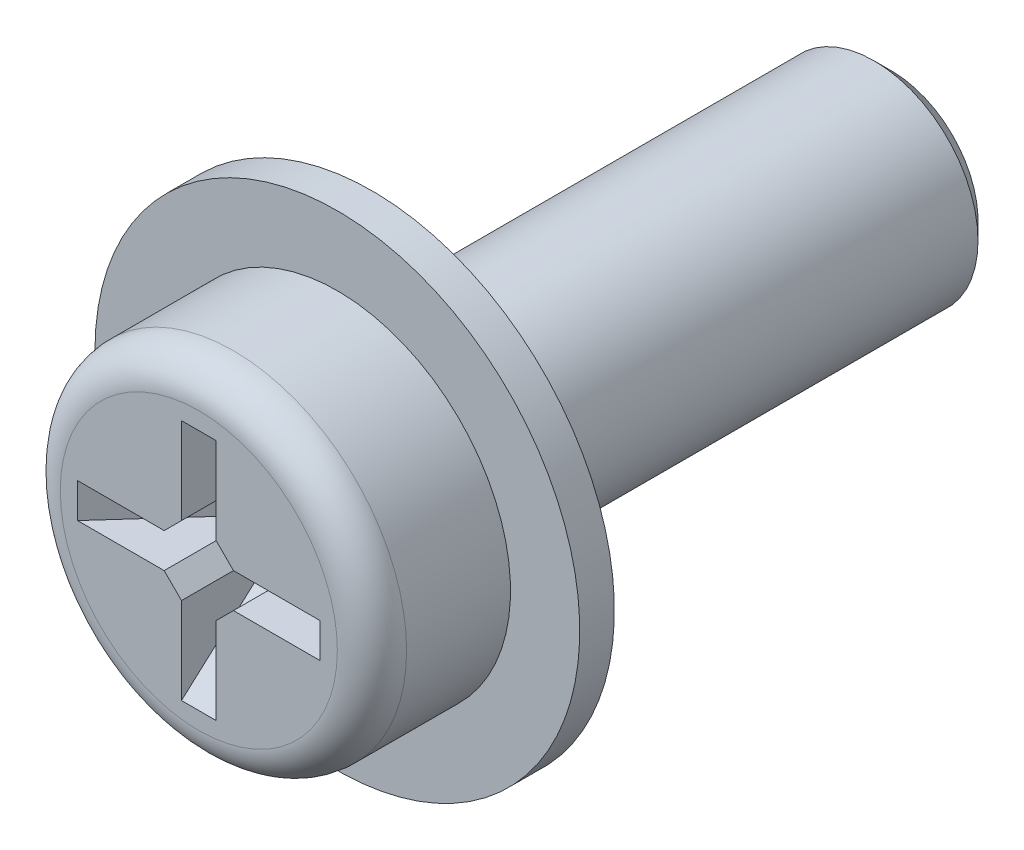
ISO-10303-21;
HEADER;
FILE_DESCRIPTION(('STEP AP214'),'2;1');
FILE_NAME('part.step','',(''),(''),'','','');
FILE_SCHEMA(('AUTOMOTIVE_DESIGN { 1 0 10303 214 1 1 1 1 }'));
ENDSEC;
DATA;
#1=APPLICATION_CONTEXT('core data for automotive mechanical design processes');
#2=APPLICATION_PROTOCOL_DEFINITION('international standard','automotive_design',2000,#1);
#3=PRODUCT_CONTEXT('',#1,'mechanical');
#4=PRODUCT('Part','Part','',(#3));
#5=PRODUCT_RELATED_PRODUCT_CATEGORY('part','',(#4));
#6=PRODUCT_DEFINITION_FORMATION('','',#4);
#7=PRODUCT_DEFINITION_CONTEXT('part definition',#1,'design');
#8=PRODUCT_DEFINITION('design','',#6,#7);
#9=PRODUCT_DEFINITION_SHAPE('','',#8);
#10=(LENGTH_UNIT() NAMED_UNIT(*) SI_UNIT(.MILLI.,.METRE.));
#11=(NAMED_UNIT(*) PLANE_ANGLE_UNIT() SI_UNIT($,.RADIAN.));
#12=(NAMED_UNIT(*) SI_UNIT($,.STERADIAN.) SOLID_ANGLE_UNIT());
#13=UNCERTAINTY_MEASURE_WITH_UNIT(LENGTH_MEASURE(1.E-05),#10,'distance_accuracy_value','');
#14=(GEOMETRIC_REPRESENTATION_CONTEXT(3) GLOBAL_UNCERTAINTY_ASSIGNED_CONTEXT((#13)) GLOBAL_UNIT_ASSIGNED_CONTEXT((#10,
#11,#12)) REPRESENTATION_CONTEXT('',''));
#15=CARTESIAN_POINT('',(0.,0.,0.));
#16=DIRECTION('',(0.,0.,1.));
#17=DIRECTION('',(1.,0.,0.));
#18=AXIS2_PLACEMENT_3D('',#15,#16,#17);
#19=CARTESIAN_POINT('',(1.75,0.25,2.));
#20=DIRECTION('',(-0.743144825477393,0.,0.669130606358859));
#21=DIRECTION('',(0.669130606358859,0.,0.743144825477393));
#22=AXIS2_PLACEMENT_3D('',#19,#20,#21);
#23=PLANE('',#22);
#24=DIRECTION('',(-0.669130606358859,0.,-0.743144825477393));
#25=VECTOR('',#24,1.);
#26=CARTESIAN_POINT('',(1.75,0.25,2.));
#27=LINE('',#26,#25);
#28=CARTESIAN_POINT('',(0.500000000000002,0.249999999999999,0.611734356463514));
#29=VERTEX_POINT('',#28);
#30=CARTESIAN_POINT('',(1.75,0.25,2.));
#31=VERTEX_POINT('',#30);
#32=EDGE_CURVE('E213',#29,#31,#27,.F.);
#33=ORIENTED_EDGE('',*,*,#32,.F.);
#34=DIRECTION('',(-0.556117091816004,0.556117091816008,-0.617630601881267));
#35=VECTOR('',#34,1.);
#36=CARTESIAN_POINT('',(1.36341722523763,-0.61341722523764,1.57065633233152));
#37=LINE('',#36,#35);
#38=CARTESIAN_POINT('',(0.375000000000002,0.375,0.472907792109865));
#39=VERTEX_POINT('',#38);
#40=EDGE_CURVE('E260',#29,#39,#37,.T.);
#41=ORIENTED_EDGE('',*,*,#40,.T.);
#42=DIRECTION('',(-0.556117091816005,-0.556117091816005,-0.617630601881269));
#43=VECTOR('',#42,1.);
#44=CARTESIAN_POINT('',(1.13146756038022,1.13146756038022,1.31305013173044));
#45=LINE('',#44,#43);
#46=CARTESIAN_POINT('',(0.0392323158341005,0.0392323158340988,0.1));
#47=VERTEX_POINT('',#46);
#48=EDGE_CURVE('E232',#39,#47,#45,.T.);
#49=ORIENTED_EDGE('',*,*,#48,.T.);
#50=DIRECTION('',(0.,-1.,0.));
#51=VECTOR('',#50,1.);
#52=CARTESIAN_POINT('',(0.0392323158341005,-0.249999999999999,0.1));
#53=LINE('',#52,#51);
#54=CARTESIAN_POINT('',(0.0392323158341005,-0.0392323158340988,0.1));
#55=VERTEX_POINT('',#54);
#56=EDGE_CURVE('E216',#55,#47,#53,.F.);
#57=ORIENTED_EDGE('',*,*,#56,.F.);
#58=DIRECTION('',(-0.556117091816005,0.556117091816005,-0.617630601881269));
#59=VECTOR('',#58,1.);
#60=CARTESIAN_POINT('',(1.13146756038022,-1.13146756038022,1.31305013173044));
#61=LINE('',#60,#59);
#62=CARTESIAN_POINT('',(0.375000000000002,-0.375,0.472907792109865));
#63=VERTEX_POINT('',#62);
#64=EDGE_CURVE('E53',#63,#55,#61,.T.);
#65=ORIENTED_EDGE('',*,*,#64,.F.);
#66=DIRECTION('',(0.556117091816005,0.556117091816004,0.617630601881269));
#67=VECTOR('',#66,1.);
#68=CARTESIAN_POINT('',(1.51805033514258,0.768050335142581,1.74239379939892));
#69=LINE('',#68,#67);
#70=CARTESIAN_POINT('',(0.500000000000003,-0.249999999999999,0.611734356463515));
#71=VERTEX_POINT('',#70);
#72=EDGE_CURVE('E271',#63,#71,#69,.T.);
#73=ORIENTED_EDGE('',*,*,#72,.T.);
#74=DIRECTION('',(-0.669130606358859,0.,-0.743144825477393));
#75=VECTOR('',#74,1.);
#76=CARTESIAN_POINT('',(0.133600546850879,-0.249999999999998,0.204806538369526));
#77=LINE('',#76,#75);
#78=CARTESIAN_POINT('',(1.75,-0.25,2.));
#79=VERTEX_POINT('',#78);
#80=EDGE_CURVE('E218',#71,#79,#77,.F.);
#81=ORIENTED_EDGE('',*,*,#80,.T.);
#82=DIRECTION('',(0.,1.,0.));
#83=VECTOR('',#82,1.);
#84=CARTESIAN_POINT('',(1.75,0.25,2.));
#85=LINE('',#84,#83);
#86=EDGE_CURVE('E186',#79,#31,#85,.T.);
#87=ORIENTED_EDGE('',*,*,#86,.T.);
#88=EDGE_LOOP('',(#33,#41,#49,#57,#65,#73,#81,#87));
#89=FACE_BOUND('',#88,.T.);
#90=ADVANCED_FACE('F29',(#89),#23,.T.);
#91=CARTESIAN_POINT('',(-0.250000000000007,1.75,2.));
#92=DIRECTION('',(0.,-0.743144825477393,0.669130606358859));
#93=DIRECTION('',(0.,-0.669130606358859,-0.743144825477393));
#94=AXIS2_PLACEMENT_3D('',#91,#92,#93);
#95=PLANE('',#94);
#96=ORIENTED_EDGE('',*,*,#48,.F.);
#97=DIRECTION('',(-0.556117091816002,0.556117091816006,0.61763060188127));
#98=VECTOR('',#97,1.);
#99=CARTESIAN_POINT('',(-0.768050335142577,1.51805033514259,1.74239379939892));
#100=LINE('',#99,#98);
#101=CARTESIAN_POINT('',(0.250000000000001,0.500000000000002,0.611734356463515));
#102=VERTEX_POINT('',#101);
#103=EDGE_CURVE('E263',#39,#102,#100,.T.);
#104=ORIENTED_EDGE('',*,*,#103,.T.);
#105=DIRECTION('',(0.,-0.669130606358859,-0.743144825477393));
#106=VECTOR('',#105,1.);
#107=CARTESIAN_POINT('',(0.250000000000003,0.80520419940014,0.950697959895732));
#108=LINE('',#107,#106);
#109=CARTESIAN_POINT('',(0.250000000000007,1.75,2.));
#110=VERTEX_POINT('',#109);
#111=EDGE_CURVE('E211',#102,#110,#108,.F.);
#112=ORIENTED_EDGE('',*,*,#111,.T.);
#113=DIRECTION('',(-1.,0.,0.));
#114=VECTOR('',#113,1.);
#115=CARTESIAN_POINT('',(-0.250000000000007,1.75,2.));
#116=LINE('',#115,#114);
#117=CARTESIAN_POINT('',(-0.250000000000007,1.75,2.));
#118=VERTEX_POINT('',#117);
#119=EDGE_CURVE('E195',#110,#118,#116,.T.);
#120=ORIENTED_EDGE('',*,*,#119,.T.);
#121=DIRECTION('',(0.,-0.669130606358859,-0.743144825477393));
#122=VECTOR('',#121,1.);
#123=CARTESIAN_POINT('',(-0.250000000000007,1.75,2.));
#124=LINE('',#123,#122);
#125=CARTESIAN_POINT('',(-0.250000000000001,0.5,0.611734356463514));
#126=VERTEX_POINT('',#125);
#127=EDGE_CURVE('E203',#126,#118,#124,.F.);
#128=ORIENTED_EDGE('',*,*,#127,.F.);
#129=DIRECTION('',(-0.556117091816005,-0.556117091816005,-0.617630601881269));
#130=VECTOR('',#129,1.);
#131=CARTESIAN_POINT('',(0.613417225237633,1.36341722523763,1.57065633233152));
#132=LINE('',#131,#130);
#133=CARTESIAN_POINT('',(-0.375000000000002,0.375,0.472907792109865));
#134=VERTEX_POINT('',#133);
#135=EDGE_CURVE('E265',#126,#134,#132,.T.);
#136=ORIENTED_EDGE('',*,*,#135,.T.);
#137=DIRECTION('',(0.556117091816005,-0.556117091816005,-0.617630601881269));
#138=VECTOR('',#137,1.);
#139=CARTESIAN_POINT('',(-1.28610067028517,1.28610067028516,1.48478759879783));
#140=LINE('',#139,#138);
#141=CARTESIAN_POINT('',(-0.0392323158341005,0.0392323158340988,0.1));
#142=VERTEX_POINT('',#141);
#143=EDGE_CURVE('E229',#134,#142,#140,.T.);
#144=ORIENTED_EDGE('',*,*,#143,.T.);
#145=DIRECTION('',(1.,0.,0.));
#146=VECTOR('',#145,1.);
#147=CARTESIAN_POINT('',(-0.249999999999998,0.0392323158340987,0.1));
#148=LINE('',#147,#146);
#149=EDGE_CURVE('E156',#47,#142,#148,.F.);
#150=ORIENTED_EDGE('',*,*,#149,.F.);
#151=EDGE_LOOP('',(#96,#104,#112,#120,#128,#136,#144,#150));
#152=FACE_BOUND('',#151,.T.);
#153=ADVANCED_FACE('F31',(#152),#95,.T.);
#154=CARTESIAN_POINT('',(-0.250000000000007,-1.75,2.));
#155=DIRECTION('',(0.,0.743144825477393,0.669130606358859));
#156=DIRECTION('',(0.,-0.669130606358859,0.743144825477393));
#157=AXIS2_PLACEMENT_3D('',#154,#155,#156);
#158=PLANE('',#157);
#159=DIRECTION('',(0.,0.669130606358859,-0.743144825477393));
#160=VECTOR('',#159,1.);
#161=CARTESIAN_POINT('',(0.250000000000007,-1.75,2.));
#162=LINE('',#161,#160);
#163=CARTESIAN_POINT('',(0.250000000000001,-0.5,0.611734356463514));
#164=VERTEX_POINT('',#163);
#165=CARTESIAN_POINT('',(0.250000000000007,-1.75,2.));
#166=VERTEX_POINT('',#165);
#167=EDGE_CURVE('E220',#164,#166,#162,.F.);
#168=ORIENTED_EDGE('',*,*,#167,.F.);
#169=DIRECTION('',(0.556117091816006,0.556117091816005,-0.617630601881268));
#170=VECTOR('',#169,1.);
#171=CARTESIAN_POINT('',(-0.768050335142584,-1.51805033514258,1.74239379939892));
#172=LINE('',#171,#170);
#173=EDGE_CURVE('E269',#164,#63,#172,.T.);
#174=ORIENTED_EDGE('',*,*,#173,.T.);
#175=ORIENTED_EDGE('',*,*,#64,.T.);
#176=DIRECTION('',(-1.,0.,0.));
#177=VECTOR('',#176,1.);
#178=CARTESIAN_POINT('',(-0.249999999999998,-0.0392323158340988,0.1));
#179=LINE('',#178,#177);
#180=CARTESIAN_POINT('',(-0.0392323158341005,-0.0392323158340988,0.1));
#181=VERTEX_POINT('',#180);
#182=EDGE_CURVE('E208',#181,#55,#179,.F.);
#183=ORIENTED_EDGE('',*,*,#182,.F.);
#184=DIRECTION('',(0.556117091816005,0.556117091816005,-0.617630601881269));
#185=VECTOR('',#184,1.);
#186=CARTESIAN_POINT('',(-1.28610067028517,-1.28610067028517,1.48478759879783));
#187=LINE('',#186,#185);
#188=CARTESIAN_POINT('',(-0.375000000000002,-0.375,0.472907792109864));
#189=VERTEX_POINT('',#188);
#190=EDGE_CURVE('E45',#189,#181,#187,.T.);
#191=ORIENTED_EDGE('',*,*,#190,.F.);
#192=DIRECTION('',(0.556117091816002,-0.556117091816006,0.61763060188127));
#193=VECTOR('',#192,1.);
#194=CARTESIAN_POINT('',(0.613417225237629,-1.36341722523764,1.57065633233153));
#195=LINE('',#194,#193);
#196=CARTESIAN_POINT('',(-0.250000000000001,-0.500000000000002,0.611734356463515));
#197=VERTEX_POINT('',#196);
#198=EDGE_CURVE('E275',#189,#197,#195,.T.);
#199=ORIENTED_EDGE('',*,*,#198,.T.);
#200=DIRECTION('',(0.,0.669130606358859,-0.743144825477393));
#201=VECTOR('',#200,1.);
#202=CARTESIAN_POINT('',(-0.25,-0.133600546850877,0.204806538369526));
#203=LINE('',#202,#201);
#204=CARTESIAN_POINT('',(-0.250000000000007,-1.75,2.));
#205=VERTEX_POINT('',#204);
#206=EDGE_CURVE('E210',#197,#205,#203,.F.);
#207=ORIENTED_EDGE('',*,*,#206,.T.);
#208=DIRECTION('',(1.,0.,0.));
#209=VECTOR('',#208,1.);
#210=CARTESIAN_POINT('',(-0.250000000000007,-1.75,2.));
#211=LINE('',#210,#209);
#212=EDGE_CURVE('E177',#205,#166,#211,.T.);
#213=ORIENTED_EDGE('',*,*,#212,.T.);
#214=EDGE_LOOP('',(#168,#174,#175,#183,#191,#199,#207,#213));
#215=FACE_BOUND('',#214,.T.);
#216=ADVANCED_FACE('F302',(#215),#158,.T.);
#217=CARTESIAN_POINT('',(-1.75,0.25,2.));
#218=DIRECTION('',(0.743144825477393,0.,0.669130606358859));
#219=DIRECTION('',(0.669130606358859,0.,-0.743144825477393));
#220=AXIS2_PLACEMENT_3D('',#217,#218,#219);
#221=PLANE('',#220);
#222=ORIENTED_EDGE('',*,*,#143,.F.);
#223=DIRECTION('',(-0.556117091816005,-0.556117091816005,0.617630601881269));
#224=VECTOR('',#223,1.);
#225=CARTESIAN_POINT('',(-1.36341722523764,-0.613417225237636,1.57065633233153));
#226=LINE('',#225,#224);
#227=CARTESIAN_POINT('',(-0.500000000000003,0.249999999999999,0.611734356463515));
#228=VERTEX_POINT('',#227);
#229=EDGE_CURVE('E151',#134,#228,#226,.T.);
#230=ORIENTED_EDGE('',*,*,#229,.T.);
#231=DIRECTION('',(0.669130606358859,0.,-0.743144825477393));
#232=VECTOR('',#231,1.);
#233=CARTESIAN_POINT('',(-0.805204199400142,0.249999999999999,0.950697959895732));
#234=LINE('',#233,#232);
#235=CARTESIAN_POINT('',(-1.75,0.25,2.));
#236=VERTEX_POINT('',#235);
#237=EDGE_CURVE('E143',#228,#236,#234,.F.);
#238=ORIENTED_EDGE('',*,*,#237,.T.);
#239=DIRECTION('',(0.,-1.,0.));
#240=VECTOR('',#239,1.);
#241=CARTESIAN_POINT('',(-1.75,0.25,2.));
#242=LINE('',#241,#240);
#243=CARTESIAN_POINT('',(-1.75,-0.25,2.));
#244=VERTEX_POINT('',#243);
#245=EDGE_CURVE('E148',#236,#244,#242,.T.);
#246=ORIENTED_EDGE('',*,*,#245,.T.);
#247=DIRECTION('',(0.669130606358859,0.,-0.743144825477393));
#248=VECTOR('',#247,1.);
#249=CARTESIAN_POINT('',(-1.75,-0.25,2.));
#250=LINE('',#249,#248);
#251=CARTESIAN_POINT('',(-0.500000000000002,-0.249999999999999,0.611734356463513));
#252=VERTEX_POINT('',#251);
#253=EDGE_CURVE('E155',#252,#244,#250,.F.);
#254=ORIENTED_EDGE('',*,*,#253,.F.);
#255=DIRECTION('',(0.556117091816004,-0.556117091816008,-0.617630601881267));
#256=VECTOR('',#255,1.);
#257=CARTESIAN_POINT('',(-1.51805033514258,0.768050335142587,1.74239379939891));
#258=LINE('',#257,#256);
#259=EDGE_CURVE('E273',#252,#189,#258,.T.);
#260=ORIENTED_EDGE('',*,*,#259,.T.);
#261=ORIENTED_EDGE('',*,*,#190,.T.);
#262=DIRECTION('',(0.,1.,0.));
#263=VECTOR('',#262,1.);
#264=CARTESIAN_POINT('',(-0.0392323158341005,-0.249999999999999,0.1));
#265=LINE('',#264,#263);
#266=EDGE_CURVE('E198',#142,#181,#265,.F.);
#267=ORIENTED_EDGE('',*,*,#266,.F.);
#268=EDGE_LOOP('',(#222,#230,#238,#246,#254,#260,#261,#267));
#269=FACE_BOUND('',#268,.T.);
#270=ADVANCED_FACE('F145',(#269),#221,.T.);
#271=CARTESIAN_POINT('',(0.,0.,2.));
#272=DIRECTION('',(0.,0.,-1.));
#273=DIRECTION('',(-1.,0.,0.));
#274=AXIS2_PLACEMENT_3D('',#271,#272,#273);
#275=CYLINDRICAL_SURFACE('',#274,2.5);
#276=CARTESIAN_POINT('',(0.,0.,1.5));
#277=DIRECTION('',(0.,0.,1.));
#278=DIRECTION('',(1.,0.,0.));
#279=AXIS2_PLACEMENT_3D('',#276,#277,#278);
#280=CIRCLE('',#279,2.5);
#281=CARTESIAN_POINT('',(2.5,0.,1.5));
#282=VERTEX_POINT('',#281);
#283=EDGE_CURVE('E202',#282,#282,#280,.F.);
#284=ORIENTED_EDGE('',*,*,#283,.T.);
#285=EDGE_LOOP('',(#284));
#286=FACE_BOUND('',#285,.T.);
#287=CARTESIAN_POINT('',(0.,0.,0.));
#288=DIRECTION('',(0.,0.,-1.));
#289=DIRECTION('',(-1.,0.,0.));
#290=AXIS2_PLACEMENT_3D('',#287,#288,#289);
#291=CIRCLE('',#290,2.5);
#292=CARTESIAN_POINT('',(-2.5,0.,0.));
#293=VERTEX_POINT('',#292);
#294=EDGE_CURVE('E389',#293,#293,#291,.T.);
#295=ORIENTED_EDGE('',*,*,#294,.F.);
#296=EDGE_LOOP('',(#295));
#297=FACE_BOUND('',#296,.T.);
#298=ADVANCED_FACE('F310',(#286,#297),#275,.T.);
#299=CARTESIAN_POINT('',(0.,0.,2.));
#300=DIRECTION('',(0.,0.,1.));
#301=DIRECTION('',(1.,0.,0.));
#302=AXIS2_PLACEMENT_3D('',#299,#300,#301);
#303=PLANE('',#302);
#304=DIRECTION('',(0.,1.,0.));
#305=VECTOR('',#304,1.);
#306=CARTESIAN_POINT('',(0.250000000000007,1.75,2.));
#307=LINE('',#306,#305);
#308=CARTESIAN_POINT('',(0.250000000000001,0.500000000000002,2.));
#309=VERTEX_POINT('',#308);
#310=EDGE_CURVE('E192',#309,#110,#307,.T.);
#311=ORIENTED_EDGE('',*,*,#310,.F.);
#312=DIRECTION('',(-0.707106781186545,0.70710678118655,0.));
#313=VECTOR('',#312,1.);
#314=CARTESIAN_POINT('',(0.375000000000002,0.374999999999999,2.));
#315=LINE('',#314,#313);
#316=CARTESIAN_POINT('',(0.500000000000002,0.249999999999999,2.));
#317=VERTEX_POINT('',#316);
#318=EDGE_CURVE('E243',#309,#317,#315,.F.);
#319=ORIENTED_EDGE('',*,*,#318,.T.);
#320=DIRECTION('',(-1.,0.,0.));
#321=VECTOR('',#320,1.);
#322=CARTESIAN_POINT('',(0.25,0.249999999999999,2.));
#323=LINE('',#322,#321);
#324=EDGE_CURVE('E189',#31,#317,#323,.T.);
#325=ORIENTED_EDGE('',*,*,#324,.F.);
#326=ORIENTED_EDGE('',*,*,#86,.F.);
#327=DIRECTION('',(1.,0.,0.));
#328=VECTOR('',#327,1.);
#329=CARTESIAN_POINT('',(0.25,-0.249999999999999,2.));
#330=LINE('',#329,#328);
#331=CARTESIAN_POINT('',(0.500000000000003,-0.249999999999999,2.));
#332=VERTEX_POINT('',#331);
#333=EDGE_CURVE('E183',#332,#79,#330,.T.);
#334=ORIENTED_EDGE('',*,*,#333,.F.);
#335=DIRECTION('',(0.707106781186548,0.707106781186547,0.));
#336=VECTOR('',#335,1.);
#337=CARTESIAN_POINT('',(0.375000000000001,-0.375000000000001,2.));
#338=LINE('',#337,#336);
#339=CARTESIAN_POINT('',(0.250000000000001,-0.5,2.));
#340=VERTEX_POINT('',#339);
#341=EDGE_CURVE('E239',#332,#340,#338,.F.);
#342=ORIENTED_EDGE('',*,*,#341,.T.);
#343=DIRECTION('',(0.,1.,0.));
#344=VECTOR('',#343,1.);
#345=CARTESIAN_POINT('',(0.25,-0.249999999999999,2.));
#346=LINE('',#345,#344);
#347=EDGE_CURVE('E180',#166,#340,#346,.T.);
#348=ORIENTED_EDGE('',*,*,#347,.F.);
#349=ORIENTED_EDGE('',*,*,#212,.F.);
#350=DIRECTION('',(0.,-1.,0.));
#351=VECTOR('',#350,1.);
#352=CARTESIAN_POINT('',(-0.25,-0.249999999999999,2.));
#353=LINE('',#352,#351);
#354=CARTESIAN_POINT('',(-0.250000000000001,-0.500000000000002,2.));
#355=VERTEX_POINT('',#354);
#356=EDGE_CURVE('E171',#355,#205,#353,.T.);
#357=ORIENTED_EDGE('',*,*,#356,.F.);
#358=DIRECTION('',(0.707106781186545,-0.70710678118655,0.));
#359=VECTOR('',#358,1.);
#360=CARTESIAN_POINT('',(-0.375000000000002,-0.374999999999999,2.));
#361=LINE('',#360,#359);
#362=CARTESIAN_POINT('',(-0.500000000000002,-0.249999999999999,2.));
#363=VERTEX_POINT('',#362);
#364=EDGE_CURVE('E237',#355,#363,#361,.F.);
#365=ORIENTED_EDGE('',*,*,#364,.T.);
#366=DIRECTION('',(1.,0.,0.));
#367=VECTOR('',#366,1.);
#368=CARTESIAN_POINT('',(-1.75,-0.25,2.));
#369=LINE('',#368,#367);
#370=EDGE_CURVE('E169',#244,#363,#369,.T.);
#371=ORIENTED_EDGE('',*,*,#370,.F.);
#372=ORIENTED_EDGE('',*,*,#245,.F.);
#373=DIRECTION('',(-1.,0.,0.));
#374=VECTOR('',#373,1.);
#375=CARTESIAN_POINT('',(-1.75,0.25,2.));
#376=LINE('',#375,#374);
#377=CARTESIAN_POINT('',(-0.500000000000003,0.249999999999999,2.));
#378=VERTEX_POINT('',#377);
#379=EDGE_CURVE('E159',#378,#236,#376,.T.);
#380=ORIENTED_EDGE('',*,*,#379,.F.);
#381=DIRECTION('',(-0.707106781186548,-0.707106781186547,0.));
#382=VECTOR('',#381,1.);
#383=CARTESIAN_POINT('',(-0.375000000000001,0.375000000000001,2.));
#384=LINE('',#383,#382);
#385=CARTESIAN_POINT('',(-0.250000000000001,0.5,2.));
#386=VERTEX_POINT('',#385);
#387=EDGE_CURVE('E241',#378,#386,#384,.F.);
#388=ORIENTED_EDGE('',*,*,#387,.T.);
#389=DIRECTION('',(0.,-1.,0.));
#390=VECTOR('',#389,1.);
#391=CARTESIAN_POINT('',(-0.250000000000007,1.75,2.));
#392=LINE('',#391,#390);
#393=EDGE_CURVE('E163',#118,#386,#392,.T.);
#394=ORIENTED_EDGE('',*,*,#393,.F.);
#395=ORIENTED_EDGE('',*,*,#119,.F.);
#396=EDGE_LOOP('',(#311,#319,#325,#326,#334,#342,#348,#349,#357,#365,#371,#372,#380,#388,#394,#395));
#397=FACE_BOUND('',#396,.T.);
#398=CARTESIAN_POINT('',(0.,0.,2.));
#399=DIRECTION('',(0.,0.,1.));
#400=DIRECTION('',(1.,0.,0.));
#401=AXIS2_PLACEMENT_3D('',#398,#399,#400);
#402=CIRCLE('',#401,2.);
#403=CARTESIAN_POINT('',(2.,0.,2.));
#404=VERTEX_POINT('',#403);
#405=EDGE_CURVE('E199',#404,#404,#402,.T.);
#406=ORIENTED_EDGE('',*,*,#405,.T.);
#407=EDGE_LOOP('',(#406));
#408=FACE_BOUND('',#407,.T.);
#409=ADVANCED_FACE('F166',(#397,#408),#303,.T.);
#410=CARTESIAN_POINT('',(0.,0.,1.5));
#411=DIRECTION('',(0.,0.,1.));
#412=DIRECTION('',(1.,0.,0.));
#413=AXIS2_PLACEMENT_3D('',#410,#411,#412);
#414=TOROIDAL_SURFACE('',#413,2.,0.5);
#415=ORIENTED_EDGE('',*,*,#283,.F.);
#416=EDGE_LOOP('',(#415));
#417=FACE_BOUND('',#416,.T.);
#418=ORIENTED_EDGE('',*,*,#405,.F.);
#419=EDGE_LOOP('',(#418));
#420=FACE_BOUND('',#419,.T.);
#421=ADVANCED_FACE('F315',(#417,#420),#414,.T.);
#422=CARTESIAN_POINT('',(-0.250000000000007,1.75,0.1));
#423=DIRECTION('',(-1.,0.,0.));
#424=DIRECTION('',(0.,-1.,0.));
#425=AXIS2_PLACEMENT_3D('',#422,#423,#424);
#426=PLANE('',#425);
#427=ORIENTED_EDGE('',*,*,#393,.T.);
#428=DIRECTION('',(0.,0.,-1.));
#429=VECTOR('',#428,1.);
#430=CARTESIAN_POINT('',(-0.250000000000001,0.5,0.1));
#431=LINE('',#430,#429);
#432=EDGE_CURVE('E248',#386,#126,#431,.T.);
#433=ORIENTED_EDGE('',*,*,#432,.T.);
#434=ORIENTED_EDGE('',*,*,#127,.T.);
#435=EDGE_LOOP('',(#427,#433,#434));
#436=FACE_BOUND('',#435,.T.);
#437=ADVANCED_FACE('F319',(#436),#426,.F.);
#438=CARTESIAN_POINT('',(0.250000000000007,1.75,0.1));
#439=DIRECTION('',(1.,0.,0.));
#440=DIRECTION('',(0.,1.,0.));
#441=AXIS2_PLACEMENT_3D('',#438,#439,#440);
#442=PLANE('',#441);
#443=ORIENTED_EDGE('',*,*,#111,.F.);
#444=DIRECTION('',(0.,0.,1.));
#445=VECTOR('',#444,1.);
#446=CARTESIAN_POINT('',(0.250000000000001,0.500000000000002,0.1));
#447=LINE('',#446,#445);
#448=EDGE_CURVE('E234',#102,#309,#447,.T.);
#449=ORIENTED_EDGE('',*,*,#448,.T.);
#450=ORIENTED_EDGE('',*,*,#310,.T.);
#451=EDGE_LOOP('',(#443,#449,#450));
#452=FACE_BOUND('',#451,.T.);
#453=ADVANCED_FACE('F323',(#452),#442,.F.);
#454=CARTESIAN_POINT('',(0.25,0.249999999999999,0.1));
#455=DIRECTION('',(0.,1.,0.));
#456=DIRECTION('',(-1.,0.,0.));
#457=AXIS2_PLACEMENT_3D('',#454,#455,#456);
#458=PLANE('',#457);
#459=ORIENTED_EDGE('',*,*,#324,.T.);
#460=DIRECTION('',(0.,0.,-1.));
#461=VECTOR('',#460,1.);
#462=CARTESIAN_POINT('',(0.500000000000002,0.249999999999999,0.1));
#463=LINE('',#462,#461);
#464=EDGE_CURVE('E245',#317,#29,#463,.T.);
#465=ORIENTED_EDGE('',*,*,#464,.T.);
#466=ORIENTED_EDGE('',*,*,#32,.T.);
#467=EDGE_LOOP('',(#459,#465,#466));
#468=FACE_BOUND('',#467,.T.);
#469=ADVANCED_FACE('F343',(#468),#458,.F.);
#470=CARTESIAN_POINT('',(0.25,-0.249999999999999,0.1));
#471=DIRECTION('',(0.,-1.,0.));
#472=DIRECTION('',(1.,0.,0.));
#473=AXIS2_PLACEMENT_3D('',#470,#471,#472);
#474=PLANE('',#473);
#475=ORIENTED_EDGE('',*,*,#80,.F.);
#476=DIRECTION('',(0.,0.,1.));
#477=VECTOR('',#476,1.);
#478=CARTESIAN_POINT('',(0.500000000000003,-0.249999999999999,0.1));
#479=LINE('',#478,#477);
#480=EDGE_CURVE('E250',#71,#332,#479,.T.);
#481=ORIENTED_EDGE('',*,*,#480,.T.);
#482=ORIENTED_EDGE('',*,*,#333,.T.);
#483=EDGE_LOOP('',(#475,#481,#482));
#484=FACE_BOUND('',#483,.T.);
#485=ADVANCED_FACE('F339',(#484),#474,.F.);
#486=CARTESIAN_POINT('',(0.25,-0.249999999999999,0.1));
#487=DIRECTION('',(1.,0.,0.));
#488=DIRECTION('',(0.,1.,0.));
#489=AXIS2_PLACEMENT_3D('',#486,#487,#488);
#490=PLANE('',#489);
#491=ORIENTED_EDGE('',*,*,#347,.T.);
#492=DIRECTION('',(0.,0.,-1.));
#493=VECTOR('',#492,1.);
#494=CARTESIAN_POINT('',(0.250000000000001,-0.5,0.1));
#495=LINE('',#494,#493);
#496=EDGE_CURVE('E253',#340,#164,#495,.T.);
#497=ORIENTED_EDGE('',*,*,#496,.T.);
#498=ORIENTED_EDGE('',*,*,#167,.T.);
#499=EDGE_LOOP('',(#491,#497,#498));
#500=FACE_BOUND('',#499,.T.);
#501=ADVANCED_FACE('F335',(#500),#490,.F.);
#502=CARTESIAN_POINT('',(-0.25,-0.249999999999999,0.1));
#503=DIRECTION('',(-1.,0.,0.));
#504=DIRECTION('',(0.,-1.,0.));
#505=AXIS2_PLACEMENT_3D('',#502,#503,#504);
#506=PLANE('',#505);
#507=ORIENTED_EDGE('',*,*,#206,.F.);
#508=DIRECTION('',(0.,0.,1.));
#509=VECTOR('',#508,1.);
#510=CARTESIAN_POINT('',(-0.250000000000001,-0.500000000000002,0.1));
#511=LINE('',#510,#509);
#512=EDGE_CURVE('E255',#197,#355,#511,.T.);
#513=ORIENTED_EDGE('',*,*,#512,.T.);
#514=ORIENTED_EDGE('',*,*,#356,.T.);
#515=EDGE_LOOP('',(#507,#513,#514));
#516=FACE_BOUND('',#515,.T.);
#517=ADVANCED_FACE('F331',(#516),#506,.F.);
#518=CARTESIAN_POINT('',(-1.75,-0.25,0.1));
#519=DIRECTION('',(0.,-1.,0.));
#520=DIRECTION('',(1.,0.,0.));
#521=AXIS2_PLACEMENT_3D('',#518,#519,#520);
#522=PLANE('',#521);
#523=ORIENTED_EDGE('',*,*,#370,.T.);
#524=DIRECTION('',(0.,0.,-1.));
#525=VECTOR('',#524,1.);
#526=CARTESIAN_POINT('',(-0.500000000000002,-0.249999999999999,0.1));
#527=LINE('',#526,#525);
#528=EDGE_CURVE('E258',#363,#252,#527,.T.);
#529=ORIENTED_EDGE('',*,*,#528,.T.);
#530=ORIENTED_EDGE('',*,*,#253,.T.);
#531=EDGE_LOOP('',(#523,#529,#530));
#532=FACE_BOUND('',#531,.T.);
#533=ADVANCED_FACE('F328',(#532),#522,.F.);
#534=CARTESIAN_POINT('',(-1.75,0.25,0.1));
#535=DIRECTION('',(0.,1.,0.));
#536=DIRECTION('',(-1.,0.,0.));
#537=AXIS2_PLACEMENT_3D('',#534,#535,#536);
#538=PLANE('',#537);
#539=ORIENTED_EDGE('',*,*,#237,.F.);
#540=DIRECTION('',(0.,0.,1.));
#541=VECTOR('',#540,1.);
#542=CARTESIAN_POINT('',(-0.500000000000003,0.249999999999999,0.1));
#543=LINE('',#542,#541);
#544=EDGE_CURVE('E161',#228,#378,#543,.T.);
#545=ORIENTED_EDGE('',*,*,#544,.T.);
#546=ORIENTED_EDGE('',*,*,#379,.T.);
#547=EDGE_LOOP('',(#539,#545,#546));
#548=FACE_BOUND('',#547,.T.);
#549=ADVANCED_FACE('F160',(#548),#538,.F.);
#550=CARTESIAN_POINT('',(-0.249999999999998,-0.249999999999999,0.1));
#551=DIRECTION('',(0.,0.,1.));
#552=DIRECTION('',(1.,0.,0.));
#553=AXIS2_PLACEMENT_3D('',#550,#551,#552);
#554=PLANE('',#553);
#555=ORIENTED_EDGE('',*,*,#149,.T.);
#556=ORIENTED_EDGE('',*,*,#266,.T.);
#557=ORIENTED_EDGE('',*,*,#182,.T.);
#558=ORIENTED_EDGE('',*,*,#56,.T.);
#559=EDGE_LOOP('',(#555,#556,#557,#558));
#560=FACE_BOUND('',#559,.T.);
#561=ADVANCED_FACE('F327',(#560),#554,.T.);
#562=CARTESIAN_POINT('',(0.250000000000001,0.500000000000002,0.1));
#563=DIRECTION('',(0.70710678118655,0.707106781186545,0.));
#564=DIRECTION('',(-0.707106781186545,0.70710678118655,0.));
#565=AXIS2_PLACEMENT_3D('',#562,#563,#564);
#566=PLANE('',#565);
#567=ORIENTED_EDGE('',*,*,#40,.F.);
#568=ORIENTED_EDGE('',*,*,#464,.F.);
#569=ORIENTED_EDGE('',*,*,#318,.F.);
#570=ORIENTED_EDGE('',*,*,#448,.F.);
#571=ORIENTED_EDGE('',*,*,#103,.F.);
#572=EDGE_LOOP('',(#567,#568,#569,#570,#571));
#573=FACE_BOUND('',#572,.T.);
#574=ADVANCED_FACE('F353',(#573),#566,.F.);
#575=CARTESIAN_POINT('',(-0.500000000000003,0.249999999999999,0.1));
#576=DIRECTION('',(-0.707106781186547,0.707106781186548,0.));
#577=DIRECTION('',(-0.707106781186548,-0.707106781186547,0.));
#578=AXIS2_PLACEMENT_3D('',#575,#576,#577);
#579=PLANE('',#578);
#580=ORIENTED_EDGE('',*,*,#135,.F.);
#581=ORIENTED_EDGE('',*,*,#432,.F.);
#582=ORIENTED_EDGE('',*,*,#387,.F.);
#583=ORIENTED_EDGE('',*,*,#544,.F.);
#584=ORIENTED_EDGE('',*,*,#229,.F.);
#585=EDGE_LOOP('',(#580,#581,#582,#583,#584));
#586=FACE_BOUND('',#585,.T.);
#587=ADVANCED_FACE('F357',(#586),#579,.F.);
#588=CARTESIAN_POINT('',(0.500000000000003,-0.249999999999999,0.1));
#589=DIRECTION('',(0.707106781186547,-0.707106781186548,0.));
#590=DIRECTION('',(0.707106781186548,0.707106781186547,0.));
#591=AXIS2_PLACEMENT_3D('',#588,#589,#590);
#592=PLANE('',#591);
#593=ORIENTED_EDGE('',*,*,#173,.F.);
#594=ORIENTED_EDGE('',*,*,#496,.F.);
#595=ORIENTED_EDGE('',*,*,#341,.F.);
#596=ORIENTED_EDGE('',*,*,#480,.F.);
#597=ORIENTED_EDGE('',*,*,#72,.F.);
#598=EDGE_LOOP('',(#593,#594,#595,#596,#597));
#599=FACE_BOUND('',#598,.T.);
#600=ADVANCED_FACE('F361',(#599),#592,.F.);
#601=CARTESIAN_POINT('',(-0.250000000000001,-0.500000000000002,0.1));
#602=DIRECTION('',(-0.70710678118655,-0.707106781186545,0.));
#603=DIRECTION('',(0.707106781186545,-0.70710678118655,0.));
#604=AXIS2_PLACEMENT_3D('',#601,#602,#603);
#605=PLANE('',#604);
#606=ORIENTED_EDGE('',*,*,#259,.F.);
#607=ORIENTED_EDGE('',*,*,#528,.F.);
#608=ORIENTED_EDGE('',*,*,#364,.F.);
#609=ORIENTED_EDGE('',*,*,#512,.F.);
#610=ORIENTED_EDGE('',*,*,#198,.F.);
#611=EDGE_LOOP('',(#606,#607,#608,#609,#610));
#612=FACE_BOUND('',#611,.T.);
#613=ADVANCED_FACE('F364',(#612),#605,.F.);
#614=CARTESIAN_POINT('',(0.,0.,-0.5));
#615=DIRECTION('',(0.,0.,-1.));
#616=DIRECTION('',(-1.,0.,0.));
#617=AXIS2_PLACEMENT_3D('',#614,#615,#616);
#618=PLANE('',#617);
#619=CARTESIAN_POINT('',(0.,0.,-0.5));
#620=DIRECTION('',(0.,0.,-1.));
#621=DIRECTION('',(-1.,0.,0.));
#622=AXIS2_PLACEMENT_3D('',#619,#620,#621);
#623=CIRCLE('',#622,3.5);
#624=CARTESIAN_POINT('',(-3.5,0.,-0.5));
#625=VERTEX_POINT('',#624);
#626=EDGE_CURVE('E393',#625,#625,#623,.T.);
#627=ORIENTED_EDGE('',*,*,#626,.T.);
#628=EDGE_LOOP('',(#627));
#629=FACE_BOUND('',#628,.T.);
#630=CARTESIAN_POINT('',(0.,0.,-0.5));
#631=DIRECTION('',(0.,0.,-1.));
#632=DIRECTION('',(-1.,0.,0.));
#633=AXIS2_PLACEMENT_3D('',#630,#631,#632);
#634=CIRCLE('',#633,1.5);
#635=CARTESIAN_POINT('',(-1.5,0.,-0.5));
#636=VERTEX_POINT('',#635);
#637=EDGE_CURVE('E33',#636,#636,#634,.T.);
#638=ORIENTED_EDGE('',*,*,#637,.F.);
#639=EDGE_LOOP('',(#638));
#640=FACE_BOUND('',#639,.T.);
#641=ADVANCED_FACE('F367',(#629,#640),#618,.T.);
#642=CARTESIAN_POINT('',(0.,0.,0.));
#643=DIRECTION('',(0.,0.,-1.));
#644=DIRECTION('',(-1.,0.,0.));
#645=AXIS2_PLACEMENT_3D('',#642,#643,#644);
#646=PLANE('',#645);
#647=CARTESIAN_POINT('',(0.,0.,0.));
#648=DIRECTION('',(0.,0.,-1.));
#649=DIRECTION('',(-1.,0.,0.));
#650=AXIS2_PLACEMENT_3D('',#647,#648,#649);
#651=CIRCLE('',#650,3.5);
#652=CARTESIAN_POINT('',(-3.5,0.,0.));
#653=VERTEX_POINT('',#652);
#654=EDGE_CURVE('E396',#653,#653,#651,.T.);
#655=ORIENTED_EDGE('',*,*,#654,.F.);
#656=EDGE_LOOP('',(#655));
#657=FACE_BOUND('',#656,.T.);
#658=ORIENTED_EDGE('',*,*,#294,.T.);
#659=EDGE_LOOP('',(#658));
#660=FACE_BOUND('',#659,.T.);
#661=ADVANCED_FACE('F372',(#657,#660),#646,.F.);
#662=CARTESIAN_POINT('',(0.,0.,-0.5));
#663=DIRECTION('',(0.,0.,1.));
#664=DIRECTION('',(1.,0.,0.));
#665=AXIS2_PLACEMENT_3D('',#662,#663,#664);
#666=CYLINDRICAL_SURFACE('',#665,3.5);
#667=ORIENTED_EDGE('',*,*,#626,.F.);
#668=EDGE_LOOP('',(#667));
#669=FACE_BOUND('',#668,.T.);
#670=ORIENTED_EDGE('',*,*,#654,.T.);
#671=EDGE_LOOP('',(#670));
#672=FACE_BOUND('',#671,.T.);
#673=ADVANCED_FACE('F293',(#669,#672),#666,.T.);
#674=CARTESIAN_POINT('',(0.,0.,-8.));
#675=DIRECTION('',(0.,0.,-1.));
#676=DIRECTION('',(-1.,0.,0.));
#677=AXIS2_PLACEMENT_3D('',#674,#675,#676);
#678=PLANE('',#677);
#679=CARTESIAN_POINT('',(0.,0.,-8.));
#680=DIRECTION('',(0.,0.,-1.));
#681=DIRECTION('',(-1.,0.,0.));
#682=AXIS2_PLACEMENT_3D('',#679,#680,#681);
#683=CIRCLE('',#682,1.25);
#684=CARTESIAN_POINT('',(-1.25,0.,-8.));
#685=VERTEX_POINT('',#684);
#686=EDGE_CURVE('E38',#685,#685,#683,.T.);
#687=ORIENTED_EDGE('',*,*,#686,.T.);
#688=EDGE_LOOP('',(#687));
#689=FACE_BOUND('',#688,.T.);
#690=ADVANCED_FACE('F280',(#689),#678,.T.);
#691=CARTESIAN_POINT('',(0.,0.,-8.));
#692=DIRECTION('',(0.,0.,1.));
#693=DIRECTION('',(1.,0.,0.));
#694=AXIS2_PLACEMENT_3D('',#691,#692,#693);
#695=CONICAL_SURFACE('',#694,1.25,0.785398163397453);
#696=CARTESIAN_POINT('',(0.,0.,-7.75));
#697=DIRECTION('',(0.,0.,-1.));
#698=DIRECTION('',(-1.,0.,0.));
#699=AXIS2_PLACEMENT_3D('',#696,#697,#698);
#700=CIRCLE('',#699,1.5);
#701=CARTESIAN_POINT('',(-1.5,0.,-7.75));
#702=VERTEX_POINT('',#701);
#703=EDGE_CURVE('E11',#702,#702,#700,.F.);
#704=ORIENTED_EDGE('',*,*,#703,.F.);
#705=EDGE_LOOP('',(#704));
#706=FACE_BOUND('',#705,.T.);
#707=ORIENTED_EDGE('',*,*,#686,.F.);
#708=EDGE_LOOP('',(#707));
#709=FACE_BOUND('',#708,.T.);
#710=ADVANCED_FACE('F282',(#706,#709),#695,.T.);
#711=CARTESIAN_POINT('',(0.,0.,-8.));
#712=DIRECTION('',(0.,0.,1.));
#713=DIRECTION('',(1.,0.,0.));
#714=AXIS2_PLACEMENT_3D('',#711,#712,#713);
#715=CYLINDRICAL_SURFACE('',#714,1.5);
#716=ORIENTED_EDGE('',*,*,#637,.T.);
#717=EDGE_LOOP('',(#716));
#718=FACE_BOUND('',#717,.T.);
#719=ORIENTED_EDGE('',*,*,#703,.T.);
#720=EDGE_LOOP('',(#719));
#721=FACE_BOUND('',#720,.T.);
#722=ADVANCED_FACE('F284',(#718,#721),#715,.T.);
#723=CLOSED_SHELL('',(#90,#153,#216,#270,#298,#409,#421,#437,#453,#469,#485,#501,#517,#533,#549,
#561,#574,#587,#600,#613,#641,#661,#673,#690,#710,#722));
#724=MANIFOLD_SOLID_BREP('B2',#723);
#725=ADVANCED_BREP_SHAPE_REPRESENTATION('',(#18,#724),#14);
#726=SHAPE_DEFINITION_REPRESENTATION(#9,#725);
ENDSEC;
END-ISO-10303-21;
